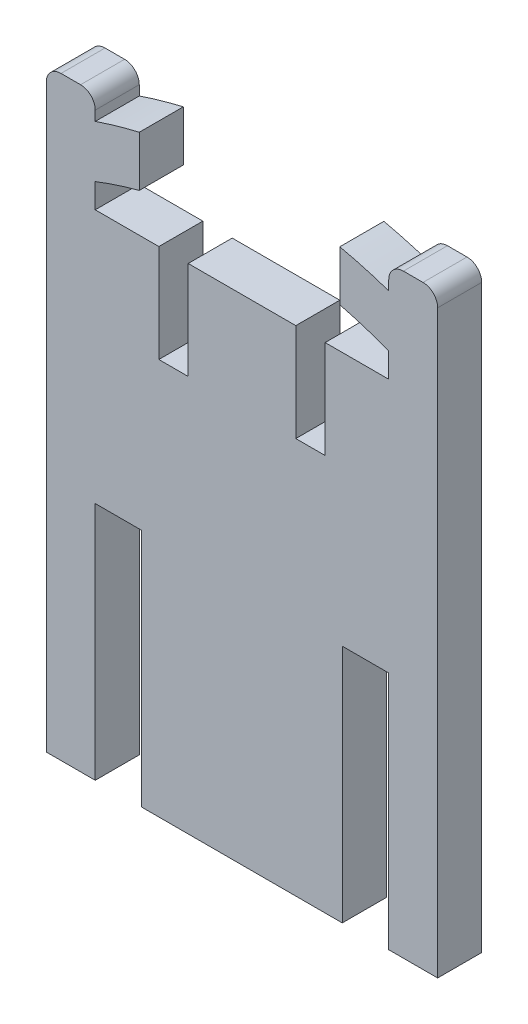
from build123d import *

# Parameters (mm, degrees)
BOSS_EXTRU_1_DEPTH      = 9
ESQUISSE3_W             = 6
ESQUISSE3_H             = 20
ENL_V_MAT_EXTRU_1_DEPTH = 10


with BuildPart() as part:
    # Esquisse2 → Boss.-Extru.1 (new body)
    with BuildSketch(Plane.XY):
        with BuildLine():
            Line((20.5, 58), (20.5, 9))
            Line((20.5, 9), (-20.5, 9))
            Line((-20.5, 9), (-20.5, 58))
            Line((-20.5, 58), (-30, 58))
            Line((-30, 58), (-30, 9))
            Line((-30, 9), (-40, 9))
            Line((-40, 9), (-40, 127.647869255))
            ThreePointArc((-40, 127.647869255), (-39.121320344, 129.769189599), (-37, 130.647869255))
            Line((-37, 130.647869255), (-33, 130.647869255))
            ThreePointArc((-33, 130.647869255), (-30.878679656, 129.769189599), (-30, 127.647869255))
            Line((-30, 127.647869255), (-30, 125.647869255))
            ThreePointArc((-30, 125.647869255), (-25.532726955, 127.054167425), (-21, 128.232551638))
            Line((-21, 128.232551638), (-21, 117.930386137))
            ThreePointArc((-21, 117.930386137), (-25.54205925, 116.59436828), (-30, 115))
            Line((-30, 115), (-30, 110))
            Line((-30, 110), (30, 110))
            Line((30, 110), (30, 115))
            ThreePointArc((30, 115), (25.050730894, 116.752645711), (20, 118.186922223))
            Line((20, 118.186922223), (20, 128.459828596))
            ThreePointArc((20, 128.459828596), (25.039504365, 127.194335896), (30, 125.647869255))
            Line((30, 125.647869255), (30, 127.647869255))
            ThreePointArc((30, 127.647869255), (30.878679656, 129.769189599), (33, 130.647869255))
            Line((33, 130.647869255), (37, 130.647869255))
            ThreePointArc((37, 130.647869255), (39.121320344, 129.769189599), (40, 127.647869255))
            Line((40, 127.647869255), (40, 9))
            Line((40, 9), (30, 9))
            Line((30, 9), (30, 58))
            Line((30, 58), (20.5, 58))
        make_face()
    extrude(amount=BOSS_EXTRU_1_DEPTH)

    # Esquisse3 → Enl_v. mat.-Extru.1 (cut)
    with BuildSketch(Plane(origin=(0, 0, 0), x_dir=(-1, 0, 0), z_dir=(0, 0, -1))):
        with Locations((-14, 100)):
            Rectangle(ESQUISSE3_W, ESQUISSE3_H)
        with Locations((14, 100)):
            Rectangle(ESQUISSE3_W, ESQUISSE3_H)
    extrude(amount=-ENL_V_MAT_EXTRU_1_DEPTH, mode=Mode.SUBTRACT)


solid = part.part
